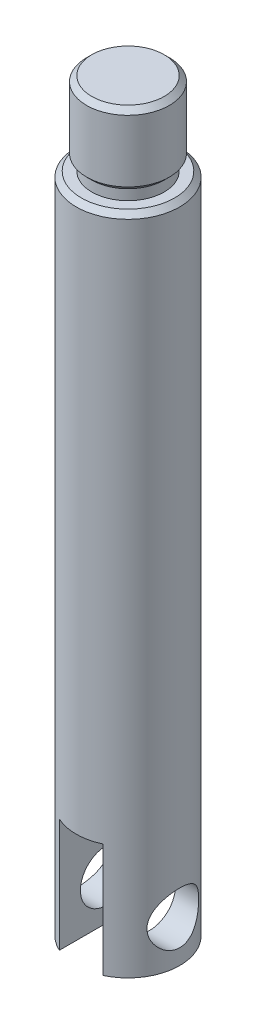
from build123d import *

# Parameters (mm, degrees)
SKETCH1_R           = 2
BOSS_EXTRUDE1_DEPTH = 3.5
CHAMFER1_SIZE       = 0.25
SKETCH2_R           = 1.75
BOSS_EXTRUDE2_DEPTH = 0.5
SKETCH3_R           = 2.5
BOSS_EXTRUDE3_DEPTH = 32
CHAMFER2_SIZE       = 0.25
SKETCH4_R           = 1.25
CUT_EXTRUDE3_DEPTH  = 4.25
SKETCH5_W           = 2.1
SKETCH5_H           = 5.195974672
CUT_EXTRUDE4_DEPTH  = 5.5


with BuildPart() as part:
    # Sketch1 → Boss-Extrude1 (new body)
    with BuildSketch(Plane(origin=(0, 0, 0), x_dir=(1, 0, 0), z_dir=(0, 1, 0))):
        with Locations(Location((0, 0, 0), (0, 0, 270))):
            Circle(SKETCH1_R)
    extrude(amount=BOSS_EXTRUDE1_DEPTH)

    # Chamfer1
    chamfer1_edges = [part.edges().sort_by_distance(p)[0] for p in [
        (0, 0, -2),
        (0, 3.5, -2),
    ]]
    chamfer(chamfer1_edges, length=CHAMFER1_SIZE)

    # Sketch2 → Boss-Extrude2 (add)
    with BuildSketch(Plane.XZ):
        with Locations(Location((0, 0, 0), (0, 0, 90))):
            Circle(SKETCH2_R)
    extrude(amount=BOSS_EXTRUDE2_DEPTH)

    # Sketch3 → Boss-Extrude3 (add)
    with BuildSketch(Plane.XZ.offset(0.5)):
        with Locations(Location((0, 0, 0), (0, 0, 270))):
            Circle(SKETCH3_R)
    extrude(amount=BOSS_EXTRUDE3_DEPTH)

    # Chamfer2
    chamfer2_edges = [part.edges().sort_by_distance(p)[0] for p in [
        (0, -0.5, 2.5),
    ]]
    chamfer(chamfer2_edges, length=CHAMFER2_SIZE)

    # Sketch4 → Cut-Extrude3 (cut, symmetric)
    with BuildSketch(Plane(origin=(0, 0, 0), x_dir=(0, 0, -1), z_dir=(1, 0, 0))):
        with Locations((0, -30.5)):
            Circle(SKETCH4_R)
    extrude(amount=CUT_EXTRUDE3_DEPTH, both=True, mode=Mode.SUBTRACT)

    # Sketch5 → Cut-Extrude4 (cut)
    with BuildSketch(Plane.XZ.offset(32.5)):
        Rectangle(SKETCH5_W, SKETCH5_H)
    extrude(amount=-CUT_EXTRUDE4_DEPTH, mode=Mode.SUBTRACT)


solid = part.part
